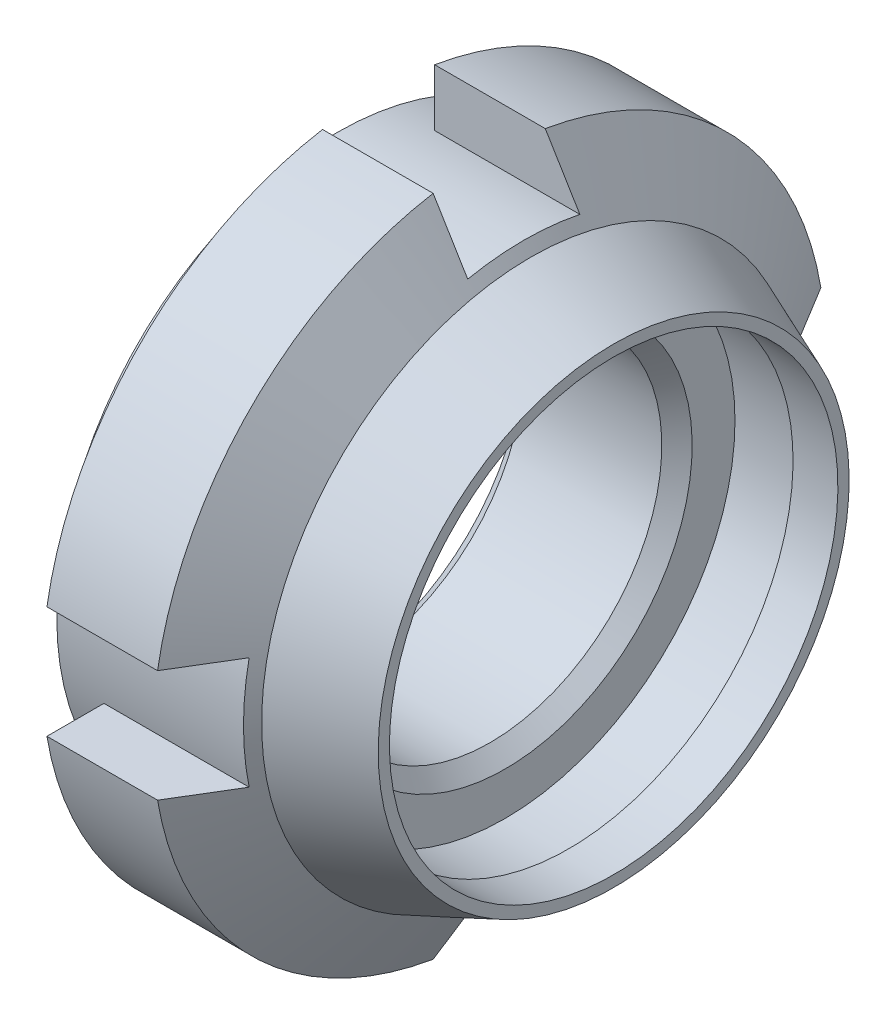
ISO-10303-21;
HEADER;
FILE_DESCRIPTION(('STEP AP214'),'2;1');
FILE_NAME('part.step','',(''),(''),'','','');
FILE_SCHEMA(('AUTOMOTIVE_DESIGN { 1 0 10303 214 1 1 1 1 }'));
ENDSEC;
DATA;
#1=APPLICATION_CONTEXT('core data for automotive mechanical design processes');
#2=APPLICATION_PROTOCOL_DEFINITION('international standard','automotive_design',2000,#1);
#3=PRODUCT_CONTEXT('',#1,'mechanical');
#4=PRODUCT('Part','Part','',(#3));
#5=PRODUCT_RELATED_PRODUCT_CATEGORY('part','',(#4));
#6=PRODUCT_DEFINITION_FORMATION('','',#4);
#7=PRODUCT_DEFINITION_CONTEXT('part definition',#1,'design');
#8=PRODUCT_DEFINITION('design','',#6,#7);
#9=PRODUCT_DEFINITION_SHAPE('','',#8);
#10=(LENGTH_UNIT() NAMED_UNIT(*) SI_UNIT(.MILLI.,.METRE.));
#11=(NAMED_UNIT(*) PLANE_ANGLE_UNIT() SI_UNIT($,.RADIAN.));
#12=(NAMED_UNIT(*) SI_UNIT($,.STERADIAN.) SOLID_ANGLE_UNIT());
#13=UNCERTAINTY_MEASURE_WITH_UNIT(LENGTH_MEASURE(1.E-05),#10,'distance_accuracy_value','');
#14=(GEOMETRIC_REPRESENTATION_CONTEXT(3) GLOBAL_UNCERTAINTY_ASSIGNED_CONTEXT((#13)) GLOBAL_UNIT_ASSIGNED_CONTEXT((#10,
#11,#12)) REPRESENTATION_CONTEXT('',''));
#15=CARTESIAN_POINT('',(0.,0.,0.));
#16=DIRECTION('',(0.,0.,1.));
#17=DIRECTION('',(1.,0.,0.));
#18=AXIS2_PLACEMENT_3D('',#15,#16,#17);
#19=CARTESIAN_POINT('',(0.,3.75,0.));
#20=DIRECTION('',(-1.,0.,0.));
#21=DIRECTION('',(0.,0.,1.));
#22=AXIS2_PLACEMENT_3D('',#19,#20,#21);
#23=PLANE('',#22);
#24=CARTESIAN_POINT('',(0.,0.,0.));
#25=DIRECTION('',(1.,0.,0.));
#26=DIRECTION('',(0.,1.,0.));
#27=AXIS2_PLACEMENT_3D('',#24,#25,#26);
#28=CIRCLE('',#27,5.);
#29=CARTESIAN_POINT('',(0.,5.,0.));
#30=VERTEX_POINT('',#29);
#31=EDGE_CURVE('E9',#30,#30,#28,.T.);
#32=ORIENTED_EDGE('',*,*,#31,.T.);
#33=EDGE_LOOP('',(#32));
#34=FACE_BOUND('',#33,.T.);
#35=CARTESIAN_POINT('',(0.,0.,0.));
#36=DIRECTION('',(-1.,0.,0.));
#37=DIRECTION('',(0.,1.,0.));
#38=AXIS2_PLACEMENT_3D('',#35,#36,#37);
#39=CIRCLE('',#38,7.5);
#40=CARTESIAN_POINT('',(0.,7.5,0.));
#41=VERTEX_POINT('',#40);
#42=EDGE_CURVE('E26',#41,#41,#39,.T.);
#43=ORIENTED_EDGE('',*,*,#42,.T.);
#44=EDGE_LOOP('',(#43));
#45=FACE_BOUND('',#44,.T.);
#46=ADVANCED_FACE('F15',(#34,#45),#23,.T.);
#47=CARTESIAN_POINT('',(1.11,8.25,0.));
#48=DIRECTION('',(-1.,0.,0.));
#49=DIRECTION('',(0.,0.,1.));
#50=AXIS2_PLACEMENT_3D('',#47,#48,#49);
#51=PLANE('',#50);
#52=DIRECTION('',(0.,1.,0.));
#53=VECTOR('',#52,1.);
#54=CARTESIAN_POINT('',(1.11,0.450765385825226,-1.5));
#55=LINE('',#54,#53);
#56=CARTESIAN_POINT('',(1.11,-8.87411967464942,-1.5));
#57=VERTEX_POINT('',#56);
#58=CARTESIAN_POINT('',(1.11,-7.34846922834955,-1.5));
#59=VERTEX_POINT('',#58);
#60=EDGE_CURVE('E190',#57,#59,#55,.T.);
#61=ORIENTED_EDGE('',*,*,#60,.T.);
#62=CARTESIAN_POINT('',(1.11,0.,0.));
#63=DIRECTION('',(-1.,0.,0.));
#64=DIRECTION('',(0.,1.,0.));
#65=AXIS2_PLACEMENT_3D('',#62,#63,#64);
#66=CIRCLE('',#65,7.5);
#67=CARTESIAN_POINT('',(1.11,-1.5,-7.34846922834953));
#68=VERTEX_POINT('',#67);
#69=EDGE_CURVE('E35',#68,#59,#66,.T.);
#70=ORIENTED_EDGE('',*,*,#69,.F.);
#71=DIRECTION('',(0.,0.,-1.));
#72=VECTOR('',#71,1.);
#73=CARTESIAN_POINT('',(1.11,-1.5,-4.43705983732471));
#74=LINE('',#73,#72);
#75=CARTESIAN_POINT('',(1.11,-1.5,-8.87411967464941));
#76=VERTEX_POINT('',#75);
#77=EDGE_CURVE('E277',#68,#76,#74,.T.);
#78=ORIENTED_EDGE('',*,*,#77,.T.);
#79=CARTESIAN_POINT('',(1.11,0.,0.));
#80=DIRECTION('',(-1.,0.,0.));
#81=DIRECTION('',(0.,1.,0.));
#82=AXIS2_PLACEMENT_3D('',#79,#80,#81);
#83=CIRCLE('',#82,9.);
#84=EDGE_CURVE('E442',#76,#57,#83,.T.);
#85=ORIENTED_EDGE('',*,*,#84,.T.);
#86=EDGE_LOOP('',(#61,#70,#78,#85));
#87=FACE_BOUND('',#86,.T.);
#88=ADVANCED_FACE('F356',(#87),#51,.T.);
#89=CARTESIAN_POINT('',(7.4,3.15,0.));
#90=DIRECTION('',(1.,0.,0.));
#91=DIRECTION('',(0.,0.,-1.));
#92=AXIS2_PLACEMENT_3D('',#89,#90,#91);
#93=PLANE('',#92);
#94=CARTESIAN_POINT('',(7.4,0.,0.));
#95=DIRECTION('',(-1.,0.,0.));
#96=DIRECTION('',(0.,1.,0.));
#97=AXIS2_PLACEMENT_3D('',#94,#95,#96);
#98=CIRCLE('',#97,6.);
#99=CARTESIAN_POINT('',(7.4,6.,0.));
#100=VERTEX_POINT('',#99);
#101=EDGE_CURVE('E454',#100,#100,#98,.T.);
#102=ORIENTED_EDGE('',*,*,#101,.T.);
#103=EDGE_LOOP('',(#102));
#104=FACE_BOUND('',#103,.T.);
#105=CARTESIAN_POINT('',(7.4,0.,0.));
#106=DIRECTION('',(-1.,0.,0.));
#107=DIRECTION('',(0.,1.,0.));
#108=AXIS2_PLACEMENT_3D('',#105,#106,#107);
#109=CIRCLE('',#108,6.3);
#110=CARTESIAN_POINT('',(7.4,6.3,0.));
#111=VERTEX_POINT('',#110);
#112=EDGE_CURVE('E166',#111,#111,#109,.T.);
#113=ORIENTED_EDGE('',*,*,#112,.F.);
#114=EDGE_LOOP('',(#113));
#115=FACE_BOUND('',#114,.T.);
#116=ADVANCED_FACE('F362',(#104,#115),#93,.T.);
#117=CARTESIAN_POINT('',(4.5,5.57317073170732,0.));
#118=DIRECTION('',(1.,0.,0.));
#119=DIRECTION('',(0.,0.,-1.));
#120=AXIS2_PLACEMENT_3D('',#117,#118,#119);
#121=PLANE('',#120);
#122=CARTESIAN_POINT('',(4.5,0.,0.));
#123=DIRECTION('',(-1.,0.,0.));
#124=DIRECTION('',(0.,1.,0.));
#125=AXIS2_PLACEMENT_3D('',#122,#123,#124);
#126=CIRCLE('',#125,5.);
#127=CARTESIAN_POINT('',(4.5,5.,0.));
#128=VERTEX_POINT('',#127);
#129=EDGE_CURVE('E457',#128,#128,#126,.T.);
#130=ORIENTED_EDGE('',*,*,#129,.T.);
#131=EDGE_LOOP('',(#130));
#132=FACE_BOUND('',#131,.T.);
#133=CARTESIAN_POINT('',(4.5,0.,0.));
#134=DIRECTION('',(-1.,0.,0.));
#135=DIRECTION('',(0.,1.,0.));
#136=AXIS2_PLACEMENT_3D('',#133,#134,#135);
#137=CIRCLE('',#136,6.14634146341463);
#138=CARTESIAN_POINT('',(4.5,6.14634146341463,0.));
#139=VERTEX_POINT('',#138);
#140=EDGE_CURVE('E175',#139,#139,#137,.T.);
#141=ORIENTED_EDGE('',*,*,#140,.F.);
#142=EDGE_LOOP('',(#141));
#143=FACE_BOUND('',#142,.T.);
#144=ADVANCED_FACE('F369',(#132,#143),#121,.T.);
#145=CARTESIAN_POINT('',(6.2,6.07317073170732,0.));
#146=DIRECTION('',(-1.,0.,0.));
#147=DIRECTION('',(0.,0.,1.));
#148=AXIS2_PLACEMENT_3D('',#145,#146,#147);
#149=PLANE('',#148);
#150=CARTESIAN_POINT('',(6.2,0.,0.));
#151=DIRECTION('',(-1.,0.,0.));
#152=DIRECTION('',(0.,1.,0.));
#153=AXIS2_PLACEMENT_3D('',#150,#151,#152);
#154=CIRCLE('',#153,6.);
#155=CARTESIAN_POINT('',(6.2,6.,0.));
#156=VERTEX_POINT('',#155);
#157=EDGE_CURVE('E480',#156,#156,#154,.T.);
#158=ORIENTED_EDGE('',*,*,#157,.F.);
#159=EDGE_LOOP('',(#158));
#160=FACE_BOUND('',#159,.T.);
#161=CARTESIAN_POINT('',(6.2,0.,0.));
#162=DIRECTION('',(-1.,0.,0.));
#163=DIRECTION('',(0.,1.,0.));
#164=AXIS2_PLACEMENT_3D('',#161,#162,#163);
#165=CIRCLE('',#164,6.14634146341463);
#166=CARTESIAN_POINT('',(6.2,6.14634146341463,0.));
#167=VERTEX_POINT('',#166);
#168=EDGE_CURVE('E252',#167,#167,#165,.T.);
#169=ORIENTED_EDGE('',*,*,#168,.T.);
#170=EDGE_LOOP('',(#169));
#171=FACE_BOUND('',#170,.T.);
#172=ADVANCED_FACE('F373',(#160,#171),#149,.T.);
#173=CARTESIAN_POINT('',(1.11,8.25,0.));
#174=DIRECTION('',(-1.,0.,0.));
#175=DIRECTION('',(0.,0.,1.));
#176=AXIS2_PLACEMENT_3D('',#173,#174,#175);
#177=PLANE('',#176);
#178=DIRECTION('',(0.,-1.,0.));
#179=VECTOR('',#178,1.);
#180=CARTESIAN_POINT('',(1.11,-0.312059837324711,1.5));
#181=LINE('',#180,#179);
#182=CARTESIAN_POINT('',(1.11,-7.34846922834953,1.5));
#183=VERTEX_POINT('',#182);
#184=CARTESIAN_POINT('',(1.11,-8.87411967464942,1.5));
#185=VERTEX_POINT('',#184);
#186=EDGE_CURVE('E180',#183,#185,#181,.T.);
#187=ORIENTED_EDGE('',*,*,#186,.T.);
#188=CARTESIAN_POINT('',(1.11,0.,0.));
#189=DIRECTION('',(-1.,0.,0.));
#190=DIRECTION('',(0.,1.,0.));
#191=AXIS2_PLACEMENT_3D('',#188,#189,#190);
#192=CIRCLE('',#191,9.);
#193=CARTESIAN_POINT('',(1.11,-1.5,8.87411967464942));
#194=VERTEX_POINT('',#193);
#195=EDGE_CURVE('E176',#185,#194,#192,.T.);
#196=ORIENTED_EDGE('',*,*,#195,.T.);
#197=DIRECTION('',(0.,0.,-1.));
#198=VECTOR('',#197,1.);
#199=CARTESIAN_POINT('',(1.11,-1.5,3.67423461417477));
#200=LINE('',#199,#198);
#201=CARTESIAN_POINT('',(1.11,-1.5,7.34846922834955));
#202=VERTEX_POINT('',#201);
#203=EDGE_CURVE('E181',#194,#202,#200,.T.);
#204=ORIENTED_EDGE('',*,*,#203,.T.);
#205=CARTESIAN_POINT('',(1.11,0.,0.));
#206=DIRECTION('',(-1.,0.,0.));
#207=DIRECTION('',(0.,1.,0.));
#208=AXIS2_PLACEMENT_3D('',#205,#206,#207);
#209=CIRCLE('',#208,7.5);
#210=EDGE_CURVE('E236',#183,#202,#209,.T.);
#211=ORIENTED_EDGE('',*,*,#210,.F.);
#212=EDGE_LOOP('',(#187,#196,#204,#211));
#213=FACE_BOUND('',#212,.T.);
#214=ADVANCED_FACE('F377',(#213),#177,.T.);
#215=CARTESIAN_POINT('',(1.11,8.25,0.));
#216=DIRECTION('',(-1.,0.,0.));
#217=DIRECTION('',(0.,0.,1.));
#218=AXIS2_PLACEMENT_3D('',#215,#216,#217);
#219=PLANE('',#218);
#220=DIRECTION('',(0.,0.,1.));
#221=VECTOR('',#220,1.);
#222=CARTESIAN_POINT('',(1.11,1.5,-3.67423461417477));
#223=LINE('',#222,#221);
#224=CARTESIAN_POINT('',(1.11,1.5,-8.87411967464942));
#225=VERTEX_POINT('',#224);
#226=CARTESIAN_POINT('',(1.11,1.5,-7.34846922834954));
#227=VERTEX_POINT('',#226);
#228=EDGE_CURVE('E194',#225,#227,#223,.T.);
#229=ORIENTED_EDGE('',*,*,#228,.T.);
#230=CARTESIAN_POINT('',(1.11,0.,0.));
#231=DIRECTION('',(-1.,0.,0.));
#232=DIRECTION('',(0.,1.,0.));
#233=AXIS2_PLACEMENT_3D('',#230,#231,#232);
#234=CIRCLE('',#233,7.5);
#235=CARTESIAN_POINT('',(1.11,7.34846922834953,-1.5));
#236=VERTEX_POINT('',#235);
#237=EDGE_CURVE('E260',#236,#227,#234,.T.);
#238=ORIENTED_EDGE('',*,*,#237,.F.);
#239=DIRECTION('',(0.,1.,0.));
#240=VECTOR('',#239,1.);
#241=CARTESIAN_POINT('',(1.11,8.56205983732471,-1.5));
#242=LINE('',#241,#240);
#243=CARTESIAN_POINT('',(1.11,8.87411967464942,-1.5));
#244=VERTEX_POINT('',#243);
#245=EDGE_CURVE('E191',#236,#244,#242,.T.);
#246=ORIENTED_EDGE('',*,*,#245,.T.);
#247=CARTESIAN_POINT('',(1.11,0.,0.));
#248=DIRECTION('',(-1.,0.,0.));
#249=DIRECTION('',(0.,1.,0.));
#250=AXIS2_PLACEMENT_3D('',#247,#248,#249);
#251=CIRCLE('',#250,9.);
#252=EDGE_CURVE('E145',#244,#225,#251,.T.);
#253=ORIENTED_EDGE('',*,*,#252,.T.);
#254=EDGE_LOOP('',(#229,#238,#246,#253));
#255=FACE_BOUND('',#254,.T.);
#256=ADVANCED_FACE('F381',(#255),#219,.T.);
#257=CARTESIAN_POINT('',(1.11,8.25,0.));
#258=DIRECTION('',(-1.,0.,0.));
#259=DIRECTION('',(0.,0.,1.));
#260=AXIS2_PLACEMENT_3D('',#257,#258,#259);
#261=PLANE('',#260);
#262=DIRECTION('',(0.,0.,1.));
#263=VECTOR('',#262,1.);
#264=CARTESIAN_POINT('',(1.11,1.5,4.43705983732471));
#265=LINE('',#264,#263);
#266=CARTESIAN_POINT('',(1.11,1.5,7.34846922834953));
#267=VERTEX_POINT('',#266);
#268=CARTESIAN_POINT('',(1.11,1.5,8.87411967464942));
#269=VERTEX_POINT('',#268);
#270=EDGE_CURVE('E202',#267,#269,#265,.T.);
#271=ORIENTED_EDGE('',*,*,#270,.T.);
#272=CARTESIAN_POINT('',(1.11,0.,0.));
#273=DIRECTION('',(-1.,0.,0.));
#274=DIRECTION('',(0.,1.,0.));
#275=AXIS2_PLACEMENT_3D('',#272,#273,#274);
#276=CIRCLE('',#275,9.);
#277=CARTESIAN_POINT('',(1.11,8.87411967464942,1.5));
#278=VERTEX_POINT('',#277);
#279=EDGE_CURVE('E198',#269,#278,#276,.T.);
#280=ORIENTED_EDGE('',*,*,#279,.T.);
#281=DIRECTION('',(0.,-1.,0.));
#282=VECTOR('',#281,1.);
#283=CARTESIAN_POINT('',(1.11,7.79923461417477,1.5));
#284=LINE('',#283,#282);
#285=CARTESIAN_POINT('',(1.11,7.34846922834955,1.5));
#286=VERTEX_POINT('',#285);
#287=EDGE_CURVE('E203',#278,#286,#284,.T.);
#288=ORIENTED_EDGE('',*,*,#287,.T.);
#289=CARTESIAN_POINT('',(1.11,0.,0.));
#290=DIRECTION('',(-1.,0.,0.));
#291=DIRECTION('',(0.,1.,0.));
#292=AXIS2_PLACEMENT_3D('',#289,#290,#291);
#293=CIRCLE('',#292,7.5);
#294=EDGE_CURVE('E221',#267,#286,#293,.T.);
#295=ORIENTED_EDGE('',*,*,#294,.F.);
#296=EDGE_LOOP('',(#271,#280,#288,#295));
#297=FACE_BOUND('',#296,.T.);
#298=ADVANCED_FACE('F385',(#297),#261,.T.);
#299=CARTESIAN_POINT('',(2.59,0.,0.));
#300=DIRECTION('',(-1.,0.,0.));
#301=DIRECTION('',(0.,0.,1.));
#302=AXIS2_PLACEMENT_3D('',#299,#300,#301);
#303=CYLINDRICAL_SURFACE('',#302,9.);
#304=DIRECTION('',(-1.,0.,0.));
#305=VECTOR('',#304,1.);
#306=CARTESIAN_POINT('',(2.59,-8.87411967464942,-1.5));
#307=LINE('',#306,#305);
#308=CARTESIAN_POINT('',(4.07,-8.87411967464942,-1.5));
#309=VERTEX_POINT('',#308);
#310=EDGE_CURVE('E302',#309,#57,#307,.T.);
#311=ORIENTED_EDGE('',*,*,#310,.T.);
#312=ORIENTED_EDGE('',*,*,#84,.F.);
#313=DIRECTION('',(1.,0.,0.));
#314=VECTOR('',#313,1.);
#315=CARTESIAN_POINT('',(2.59,-1.5,-8.87411967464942));
#316=LINE('',#315,#314);
#317=CARTESIAN_POINT('',(4.07000000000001,-1.5,-8.87411967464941));
#318=VERTEX_POINT('',#317);
#319=EDGE_CURVE('E306',#76,#318,#316,.T.);
#320=ORIENTED_EDGE('',*,*,#319,.T.);
#321=CARTESIAN_POINT('',(4.07,0.,0.));
#322=DIRECTION('',(-1.,0.,0.));
#323=DIRECTION('',(0.,1.,0.));
#324=AXIS2_PLACEMENT_3D('',#321,#322,#323);
#325=CIRCLE('',#324,9.);
#326=EDGE_CURVE('E437',#318,#309,#325,.T.);
#327=ORIENTED_EDGE('',*,*,#326,.T.);
#328=EDGE_LOOP('',(#311,#312,#320,#327));
#329=FACE_BOUND('',#328,.T.);
#330=ADVANCED_FACE('F389',(#329),#303,.T.);
#331=CARTESIAN_POINT('',(2.59,0.,0.));
#332=DIRECTION('',(-1.,0.,0.));
#333=DIRECTION('',(0.,0.,1.));
#334=AXIS2_PLACEMENT_3D('',#331,#332,#333);
#335=CYLINDRICAL_SURFACE('',#334,9.);
#336=DIRECTION('',(1.,0.,0.));
#337=VECTOR('',#336,1.);
#338=CARTESIAN_POINT('',(2.59,-8.87411967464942,1.5));
#339=LINE('',#338,#337);
#340=CARTESIAN_POINT('',(4.07,-8.87411967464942,1.5));
#341=VERTEX_POINT('',#340);
#342=EDGE_CURVE('E270',#185,#341,#339,.T.);
#343=ORIENTED_EDGE('',*,*,#342,.T.);
#344=CARTESIAN_POINT('',(4.07,0.,0.));
#345=DIRECTION('',(-1.,0.,0.));
#346=DIRECTION('',(0.,1.,0.));
#347=AXIS2_PLACEMENT_3D('',#344,#345,#346);
#348=CIRCLE('',#347,9.);
#349=CARTESIAN_POINT('',(4.07,-1.5,8.87411967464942));
#350=VERTEX_POINT('',#349);
#351=EDGE_CURVE('E266',#341,#350,#348,.T.);
#352=ORIENTED_EDGE('',*,*,#351,.T.);
#353=DIRECTION('',(-1.,0.,0.));
#354=VECTOR('',#353,1.);
#355=CARTESIAN_POINT('',(2.59,-1.5,8.87411967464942));
#356=LINE('',#355,#354);
#357=EDGE_CURVE('E155',#350,#194,#356,.T.);
#358=ORIENTED_EDGE('',*,*,#357,.T.);
#359=ORIENTED_EDGE('',*,*,#195,.F.);
#360=EDGE_LOOP('',(#343,#352,#358,#359));
#361=FACE_BOUND('',#360,.T.);
#362=ADVANCED_FACE('F393',(#361),#335,.T.);
#363=CARTESIAN_POINT('',(2.59,0.,0.));
#364=DIRECTION('',(-1.,0.,0.));
#365=DIRECTION('',(0.,0.,1.));
#366=AXIS2_PLACEMENT_3D('',#363,#364,#365);
#367=CYLINDRICAL_SURFACE('',#366,9.);
#368=DIRECTION('',(-1.,0.,0.));
#369=VECTOR('',#368,1.);
#370=CARTESIAN_POINT('',(2.59,1.5,-8.87411967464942));
#371=LINE('',#370,#369);
#372=CARTESIAN_POINT('',(4.07,1.5,-8.87411967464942));
#373=VERTEX_POINT('',#372);
#374=EDGE_CURVE('E148',#373,#225,#371,.T.);
#375=ORIENTED_EDGE('',*,*,#374,.T.);
#376=ORIENTED_EDGE('',*,*,#252,.F.);
#377=DIRECTION('',(1.,0.,0.));
#378=VECTOR('',#377,1.);
#379=CARTESIAN_POINT('',(2.59,8.87411967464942,-1.5));
#380=LINE('',#379,#378);
#381=CARTESIAN_POINT('',(4.07,8.87411967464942,-1.5));
#382=VERTEX_POINT('',#381);
#383=EDGE_CURVE('E125',#244,#382,#380,.T.);
#384=ORIENTED_EDGE('',*,*,#383,.T.);
#385=CARTESIAN_POINT('',(4.07,0.,0.));
#386=DIRECTION('',(-1.,0.,0.));
#387=DIRECTION('',(0.,1.,0.));
#388=AXIS2_PLACEMENT_3D('',#385,#386,#387);
#389=CIRCLE('',#388,9.);
#390=EDGE_CURVE('E134',#382,#373,#389,.T.);
#391=ORIENTED_EDGE('',*,*,#390,.T.);
#392=EDGE_LOOP('',(#375,#376,#384,#391));
#393=FACE_BOUND('',#392,.T.);
#394=ADVANCED_FACE('F143',(#393),#367,.T.);
#395=CARTESIAN_POINT('',(2.59,0.,0.));
#396=DIRECTION('',(-1.,0.,0.));
#397=DIRECTION('',(0.,0.,1.));
#398=AXIS2_PLACEMENT_3D('',#395,#396,#397);
#399=CYLINDRICAL_SURFACE('',#398,9.);
#400=DIRECTION('',(1.,0.,0.));
#401=VECTOR('',#400,1.);
#402=CARTESIAN_POINT('',(2.59,1.5,8.87411967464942));
#403=LINE('',#402,#401);
#404=CARTESIAN_POINT('',(4.07,1.5,8.87411967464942));
#405=VERTEX_POINT('',#404);
#406=EDGE_CURVE('E141',#269,#405,#403,.T.);
#407=ORIENTED_EDGE('',*,*,#406,.T.);
#408=CARTESIAN_POINT('',(4.07,0.,0.));
#409=DIRECTION('',(-1.,0.,0.));
#410=DIRECTION('',(0.,1.,0.));
#411=AXIS2_PLACEMENT_3D('',#408,#409,#410);
#412=CIRCLE('',#411,9.);
#413=CARTESIAN_POINT('',(4.07,8.87411967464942,1.5));
#414=VERTEX_POINT('',#413);
#415=EDGE_CURVE('E182',#405,#414,#412,.T.);
#416=ORIENTED_EDGE('',*,*,#415,.T.);
#417=DIRECTION('',(-1.,0.,0.));
#418=VECTOR('',#417,1.);
#419=CARTESIAN_POINT('',(2.59,8.87411967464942,1.5));
#420=LINE('',#419,#418);
#421=EDGE_CURVE('E186',#414,#278,#420,.T.);
#422=ORIENTED_EDGE('',*,*,#421,.T.);
#423=ORIENTED_EDGE('',*,*,#279,.F.);
#424=EDGE_LOOP('',(#407,#416,#422,#423));
#425=FACE_BOUND('',#424,.T.);
#426=ADVANCED_FACE('F400',(#425),#399,.T.);
#427=CARTESIAN_POINT('',(0.,8.87411967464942,-1.5));
#428=DIRECTION('',(0.,0.,1.));
#429=DIRECTION('',(1.,0.,0.));
#430=AXIS2_PLACEMENT_3D('',#427,#428,#429);
#431=PLANE('',#430);
#432=CARTESIAN_POINT('',(4.07,8.87411967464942,-1.5));
#433=CARTESIAN_POINT('',(4.57599572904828,8.04194670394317,-1.5));
#434=CARTESIAN_POINT('',(4.995,7.34846922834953,-1.5));
#435=(BOUNDED_CURVE() B_SPLINE_CURVE(2,(#432,#433,#434),.UNSPECIFIED.,.F.,
.F.) B_SPLINE_CURVE_WITH_KNOTS((3,3),(0.,1.74932331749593),
.UNSPECIFIED.) CURVE() GEOMETRIC_REPRESENTATION_ITEM() RATIONAL_B_SPLINE_CURVE((1.,
1.005272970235,1.00193381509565)) REPRESENTATION_ITEM(''));
#436=CARTESIAN_POINT('',(4.995,7.34846922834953,-1.5));
#437=VERTEX_POINT('',#436);
#438=EDGE_CURVE('E120',#382,#437,#435,.T.);
#439=ORIENTED_EDGE('',*,*,#438,.F.);
#440=ORIENTED_EDGE('',*,*,#383,.F.);
#441=ORIENTED_EDGE('',*,*,#245,.F.);
#442=DIRECTION('',(1.,0.,0.));
#443=VECTOR('',#442,1.);
#444=CARTESIAN_POINT('',(0.,7.34846922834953,-1.5));
#445=LINE('',#444,#443);
#446=EDGE_CURVE('E127',#236,#437,#445,.T.);
#447=ORIENTED_EDGE('',*,*,#446,.T.);
#448=EDGE_LOOP('',(#439,#440,#441,#447));
#449=FACE_BOUND('',#448,.T.);
#450=ADVANCED_FACE('F122',(#449),#431,.T.);
#451=CARTESIAN_POINT('',(0.,-8.87411967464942,1.5));
#452=DIRECTION('',(0.,0.,-1.));
#453=DIRECTION('',(-1.,0.,0.));
#454=AXIS2_PLACEMENT_3D('',#451,#452,#453);
#455=PLANE('',#454);
#456=CARTESIAN_POINT('',(4.07,-8.87411967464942,1.5));
#457=CARTESIAN_POINT('',(4.57599572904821,-8.04194670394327,1.5));
#458=CARTESIAN_POINT('',(4.995,-7.34846922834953,1.5));
#459=(BOUNDED_CURVE() B_SPLINE_CURVE(2,(#456,#457,#458),.UNSPECIFIED.,.F.,
.F.) B_SPLINE_CURVE_WITH_KNOTS((3,3),(0.,1.74932331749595),
.UNSPECIFIED.) CURVE() GEOMETRIC_REPRESENTATION_ITEM() RATIONAL_B_SPLINE_CURVE((1.,
1.00527297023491,1.00193381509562)) REPRESENTATION_ITEM(''));
#460=CARTESIAN_POINT('',(4.995,-7.34846922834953,1.5));
#461=VERTEX_POINT('',#460);
#462=EDGE_CURVE('E210',#341,#461,#459,.T.);
#463=ORIENTED_EDGE('',*,*,#462,.F.);
#464=ORIENTED_EDGE('',*,*,#342,.F.);
#465=ORIENTED_EDGE('',*,*,#186,.F.);
#466=DIRECTION('',(1.,0.,0.));
#467=VECTOR('',#466,1.);
#468=CARTESIAN_POINT('',(0.,-7.34846922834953,1.5));
#469=LINE('',#468,#467);
#470=EDGE_CURVE('E234',#183,#461,#469,.T.);
#471=ORIENTED_EDGE('',*,*,#470,.T.);
#472=EDGE_LOOP('',(#463,#464,#465,#471));
#473=FACE_BOUND('',#472,.T.);
#474=ADVANCED_FACE('F406',(#473),#455,.T.);
#475=CARTESIAN_POINT('',(0.,-1.5,7.34846922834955));
#476=DIRECTION('',(0.,1.,0.));
#477=DIRECTION('',(0.,0.,1.));
#478=AXIS2_PLACEMENT_3D('',#475,#476,#477);
#479=PLANE('',#478);
#480=CARTESIAN_POINT('',(4.99499999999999,-1.5,7.34846922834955));
#481=CARTESIAN_POINT('',(4.57599572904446,-1.5,8.04194670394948));
#482=CARTESIAN_POINT('',(4.07,-1.5,8.87411967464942));
#483=(BOUNDED_CURVE() B_SPLINE_CURVE(2,(#480,#481,#482),.UNSPECIFIED.,.F.,
.F.) B_SPLINE_CURVE_WITH_KNOTS((3,3),(0.392802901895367,2.14212621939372),
.UNSPECIFIED.) CURVE() GEOMETRIC_REPRESENTATION_ITEM() RATIONAL_B_SPLINE_CURVE((1.00193381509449,
1.00527297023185,1.)) REPRESENTATION_ITEM(''));
#484=CARTESIAN_POINT('',(4.99499999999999,-1.5,7.34846922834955));
#485=VERTEX_POINT('',#484);
#486=EDGE_CURVE('E204',#485,#350,#483,.T.);
#487=ORIENTED_EDGE('',*,*,#486,.F.);
#488=DIRECTION('',(1.,0.,0.));
#489=VECTOR('',#488,1.);
#490=CARTESIAN_POINT('',(0.,-1.5,7.34846922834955));
#491=LINE('',#490,#489);
#492=EDGE_CURVE('E228',#202,#485,#491,.T.);
#493=ORIENTED_EDGE('',*,*,#492,.F.);
#494=ORIENTED_EDGE('',*,*,#203,.F.);
#495=ORIENTED_EDGE('',*,*,#357,.F.);
#496=EDGE_LOOP('',(#487,#493,#494,#495));
#497=FACE_BOUND('',#496,.T.);
#498=ADVANCED_FACE('F409',(#497),#479,.T.);
#499=CARTESIAN_POINT('',(0.,1.5,8.87411967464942));
#500=DIRECTION('',(0.,-1.,0.));
#501=DIRECTION('',(0.,0.,-1.));
#502=AXIS2_PLACEMENT_3D('',#499,#500,#501);
#503=PLANE('',#502);
#504=CARTESIAN_POINT('',(4.07,1.5,8.87411967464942));
#505=CARTESIAN_POINT('',(4.57599572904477,1.5,8.04194670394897));
#506=CARTESIAN_POINT('',(4.995,1.5,7.34846922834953));
#507=(BOUNDED_CURVE() B_SPLINE_CURVE(2,(#504,#505,#506),.UNSPECIFIED.,.F.,
.F.) B_SPLINE_CURVE_WITH_KNOTS((3,3),(0.,1.74932331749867),
.UNSPECIFIED.) CURVE() GEOMETRIC_REPRESENTATION_ITEM() RATIONAL_B_SPLINE_CURVE((1.,
1.00527297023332,1.00193381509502)) REPRESENTATION_ITEM(''));
#508=CARTESIAN_POINT('',(4.995,1.5,7.34846922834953));
#509=VERTEX_POINT('',#508);
#510=EDGE_CURVE('E167',#405,#509,#507,.T.);
#511=ORIENTED_EDGE('',*,*,#510,.F.);
#512=ORIENTED_EDGE('',*,*,#406,.F.);
#513=ORIENTED_EDGE('',*,*,#270,.F.);
#514=DIRECTION('',(1.,0.,0.));
#515=VECTOR('',#514,1.);
#516=CARTESIAN_POINT('',(0.,1.5,7.34846922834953));
#517=LINE('',#516,#515);
#518=EDGE_CURVE('E230',#267,#509,#517,.T.);
#519=ORIENTED_EDGE('',*,*,#518,.T.);
#520=EDGE_LOOP('',(#511,#512,#513,#519));
#521=FACE_BOUND('',#520,.T.);
#522=ADVANCED_FACE('F413',(#521),#503,.T.);
#523=CARTESIAN_POINT('',(0.,7.34846922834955,1.5));
#524=DIRECTION('',(0.,0.,-1.));
#525=DIRECTION('',(-1.,0.,0.));
#526=AXIS2_PLACEMENT_3D('',#523,#524,#525);
#527=PLANE('',#526);
#528=CARTESIAN_POINT('',(4.99499999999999,7.34846922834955,1.5));
#529=CARTESIAN_POINT('',(4.57599572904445,8.0419467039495,1.5));
#530=CARTESIAN_POINT('',(4.07,8.87411967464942,1.5));
#531=(BOUNDED_CURVE() B_SPLINE_CURVE(2,(#528,#529,#530),.UNSPECIFIED.,.F.,
.F.) B_SPLINE_CURVE_WITH_KNOTS((3,3),(0.392802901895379,2.14212621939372),
.UNSPECIFIED.) CURVE() GEOMETRIC_REPRESENTATION_ITEM() RATIONAL_B_SPLINE_CURVE((1.00193381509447,
1.0052729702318,1.)) REPRESENTATION_ITEM(''));
#532=CARTESIAN_POINT('',(4.99499999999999,7.34846922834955,1.5));
#533=VERTEX_POINT('',#532);
#534=EDGE_CURVE('E160',#533,#414,#531,.T.);
#535=ORIENTED_EDGE('',*,*,#534,.F.);
#536=DIRECTION('',(1.,0.,0.));
#537=VECTOR('',#536,1.);
#538=CARTESIAN_POINT('',(0.,7.34846922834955,1.5));
#539=LINE('',#538,#537);
#540=EDGE_CURVE('E229',#286,#533,#539,.T.);
#541=ORIENTED_EDGE('',*,*,#540,.F.);
#542=ORIENTED_EDGE('',*,*,#287,.F.);
#543=ORIENTED_EDGE('',*,*,#421,.F.);
#544=EDGE_LOOP('',(#535,#541,#542,#543));
#545=FACE_BOUND('',#544,.T.);
#546=ADVANCED_FACE('F417',(#545),#527,.T.);
#547=CARTESIAN_POINT('',(0.,1.5,-7.34846922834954));
#548=DIRECTION('',(0.,-1.,0.));
#549=DIRECTION('',(0.,0.,-1.));
#550=AXIS2_PLACEMENT_3D('',#547,#548,#549);
#551=PLANE('',#550);
#552=CARTESIAN_POINT('',(4.99499999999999,1.5,-7.34846922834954));
#553=CARTESIAN_POINT('',(4.57599572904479,1.5,-8.04194670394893));
#554=CARTESIAN_POINT('',(4.07,1.5,-8.87411967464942));
#555=(BOUNDED_CURVE() B_SPLINE_CURVE(2,(#552,#553,#554),.UNSPECIFIED.,.F.,
.F.) B_SPLINE_CURVE_WITH_KNOTS((3,3),(0.392802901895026,2.14212621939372),
.UNSPECIFIED.) CURVE() GEOMETRIC_REPRESENTATION_ITEM() RATIONAL_B_SPLINE_CURVE((1.00193381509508,
1.00527297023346,1.)) REPRESENTATION_ITEM(''));
#556=CARTESIAN_POINT('',(4.99499999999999,1.5,-7.34846922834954));
#557=VERTEX_POINT('',#556);
#558=EDGE_CURVE('E130',#557,#373,#555,.T.);
#559=ORIENTED_EDGE('',*,*,#558,.F.);
#560=DIRECTION('',(1.,0.,0.));
#561=VECTOR('',#560,1.);
#562=CARTESIAN_POINT('',(0.,1.5,-7.34846922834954));
#563=LINE('',#562,#561);
#564=EDGE_CURVE('E256',#227,#557,#563,.T.);
#565=ORIENTED_EDGE('',*,*,#564,.F.);
#566=ORIENTED_EDGE('',*,*,#228,.F.);
#567=ORIENTED_EDGE('',*,*,#374,.F.);
#568=EDGE_LOOP('',(#559,#565,#566,#567));
#569=FACE_BOUND('',#568,.T.);
#570=ADVANCED_FACE('F421',(#569),#551,.T.);
#571=CARTESIAN_POINT('',(0.,-1.5,-8.87411967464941));
#572=DIRECTION('',(0.,1.,0.));
#573=DIRECTION('',(0.,0.,1.));
#574=AXIS2_PLACEMENT_3D('',#571,#572,#573);
#575=PLANE('',#574);
#576=CARTESIAN_POINT('',(4.07,-1.5,-8.87411967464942));
#577=CARTESIAN_POINT('',(4.57599572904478,-1.5,-8.04194670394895));
#578=CARTESIAN_POINT('',(4.995,-1.5,-7.34846922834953));
#579=(BOUNDED_CURVE() B_SPLINE_CURVE(2,(#576,#577,#578),.UNSPECIFIED.,.F.,
.F.) B_SPLINE_CURVE_WITH_KNOTS((3,3),(0.,1.74932331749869),
.UNSPECIFIED.) CURVE() GEOMETRIC_REPRESENTATION_ITEM() RATIONAL_B_SPLINE_CURVE((1.,
1.00527297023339,1.00193381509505)) REPRESENTATION_ITEM(''));
#580=CARTESIAN_POINT('',(4.995,-1.5,-7.34846922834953));
#581=VERTEX_POINT('',#580);
#582=EDGE_CURVE('E220',#318,#581,#579,.T.);
#583=ORIENTED_EDGE('',*,*,#582,.F.);
#584=ORIENTED_EDGE('',*,*,#319,.F.);
#585=ORIENTED_EDGE('',*,*,#77,.F.);
#586=DIRECTION('',(1.,0.,0.));
#587=VECTOR('',#586,1.);
#588=CARTESIAN_POINT('',(0.,-1.5,-7.34846922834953));
#589=LINE('',#588,#587);
#590=EDGE_CURVE('E235',#68,#581,#589,.T.);
#591=ORIENTED_EDGE('',*,*,#590,.T.);
#592=EDGE_LOOP('',(#583,#584,#585,#591));
#593=FACE_BOUND('',#592,.T.);
#594=ADVANCED_FACE('F424',(#593),#575,.T.);
#595=CARTESIAN_POINT('',(0.,-7.34846922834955,-1.5));
#596=DIRECTION('',(0.,0.,1.));
#597=DIRECTION('',(1.,0.,0.));
#598=AXIS2_PLACEMENT_3D('',#595,#596,#597);
#599=PLANE('',#598);
#600=CARTESIAN_POINT('',(4.99499999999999,-7.34846922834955,-1.5));
#601=CARTESIAN_POINT('',(4.57599572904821,-8.04194670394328,-1.5));
#602=CARTESIAN_POINT('',(4.07,-8.87411967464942,-1.5));
#603=(BOUNDED_CURVE() B_SPLINE_CURVE(2,(#600,#601,#602),.UNSPECIFIED.,.F.,
.F.) B_SPLINE_CURVE_WITH_KNOTS((3,3),(0.392802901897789,2.14212621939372),
.UNSPECIFIED.) CURVE() GEOMETRIC_REPRESENTATION_ITEM() RATIONAL_B_SPLINE_CURVE((1.00193381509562,
1.00527297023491,1.)) REPRESENTATION_ITEM(''));
#604=CARTESIAN_POINT('',(4.99499999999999,-7.34846922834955,-1.5));
#605=VERTEX_POINT('',#604);
#606=EDGE_CURVE('E211',#605,#309,#603,.T.);
#607=ORIENTED_EDGE('',*,*,#606,.F.);
#608=DIRECTION('',(1.,0.,0.));
#609=VECTOR('',#608,1.);
#610=CARTESIAN_POINT('',(0.,-7.34846922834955,-1.5));
#611=LINE('',#610,#609);
#612=EDGE_CURVE('E240',#59,#605,#611,.T.);
#613=ORIENTED_EDGE('',*,*,#612,.F.);
#614=ORIENTED_EDGE('',*,*,#60,.F.);
#615=ORIENTED_EDGE('',*,*,#310,.F.);
#616=EDGE_LOOP('',(#607,#613,#614,#615));
#617=FACE_BOUND('',#616,.T.);
#618=ADVANCED_FACE('F327',(#617),#599,.T.);
#619=CARTESIAN_POINT('',(6.8,0.,0.));
#620=DIRECTION('',(-1.,0.,0.));
#621=DIRECTION('',(0.,0.,1.));
#622=AXIS2_PLACEMENT_3D('',#619,#620,#621);
#623=CYLINDRICAL_SURFACE('',#622,6.);
#624=ORIENTED_EDGE('',*,*,#101,.F.);
#625=EDGE_LOOP('',(#624));
#626=FACE_BOUND('',#625,.T.);
#627=ORIENTED_EDGE('',*,*,#157,.T.);
#628=EDGE_LOOP('',(#627));
#629=FACE_BOUND('',#628,.T.);
#630=ADVANCED_FACE('F345',(#626,#629),#623,.F.);
#631=CARTESIAN_POINT('',(5.35,0.,0.));
#632=DIRECTION('',(-1.,0.,0.));
#633=DIRECTION('',(0.,0.,1.));
#634=AXIS2_PLACEMENT_3D('',#631,#632,#633);
#635=CYLINDRICAL_SURFACE('',#634,6.14634146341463);
#636=ORIENTED_EDGE('',*,*,#168,.F.);
#637=EDGE_LOOP('',(#636));
#638=FACE_BOUND('',#637,.T.);
#639=ORIENTED_EDGE('',*,*,#140,.T.);
#640=EDGE_LOOP('',(#639));
#641=FACE_BOUND('',#640,.T.);
#642=ADVANCED_FACE('F325',(#638,#641),#635,.F.);
#643=DIRECTION('',(0.707106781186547,0.707106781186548,0.));
#644=VECTOR('',#643,1.);
#645=CARTESIAN_POINT('',(498999.499999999,499000.,-1.22215714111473E-10));
#646=LINE('',#645,#644);
#647=CARTESIAN_POINT('',(-0.499999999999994,0.,0.));
#648=DIRECTION('',(1.,0.,0.));
#649=AXIS1_PLACEMENT('',#647,#648);
#650=SURFACE_OF_REVOLUTION('',#646,#649);
#651=ORIENTED_EDGE('',*,*,#129,.F.);
#652=EDGE_LOOP('',(#651));
#653=FACE_BOUND('',#652,.T.);
#654=CARTESIAN_POINT('',(4.094,0.,0.));
#655=DIRECTION('',(-1.,0.,0.));
#656=DIRECTION('',(0.,1.,0.));
#657=AXIS2_PLACEMENT_3D('',#654,#655,#656);
#658=CIRCLE('',#657,4.594);
#659=CARTESIAN_POINT('',(4.094,4.594,0.));
#660=VERTEX_POINT('',#659);
#661=EDGE_CURVE('E484',#660,#660,#658,.T.);
#662=ORIENTED_EDGE('',*,*,#661,.T.);
#663=EDGE_LOOP('',(#662));
#664=FACE_BOUND('',#663,.T.);
#665=ADVANCED_FACE('F321',(#653,#664),#650,.F.);
#666=CARTESIAN_POINT('',(2.25,0.,0.));
#667=DIRECTION('',(-1.,0.,0.));
#668=DIRECTION('',(0.,0.,1.));
#669=AXIS2_PLACEMENT_3D('',#666,#667,#668);
#670=CYLINDRICAL_SURFACE('',#669,4.594);
#671=ORIENTED_EDGE('',*,*,#661,.F.);
#672=EDGE_LOOP('',(#671));
#673=FACE_BOUND('',#672,.T.);
#674=CARTESIAN_POINT('',(0.405999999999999,0.,0.));
#675=DIRECTION('',(-1.,0.,0.));
#676=DIRECTION('',(0.,1.,0.));
#677=AXIS2_PLACEMENT_3D('',#674,#675,#676);
#678=CIRCLE('',#677,4.594);
#679=CARTESIAN_POINT('',(0.405999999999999,4.594,0.));
#680=VERTEX_POINT('',#679);
#681=EDGE_CURVE('E168',#680,#680,#678,.T.);
#682=ORIENTED_EDGE('',*,*,#681,.T.);
#683=EDGE_LOOP('',(#682));
#684=FACE_BOUND('',#683,.T.);
#685=ADVANCED_FACE('F17',(#673,#684),#670,.F.);
#686=DIRECTION('',(-0.707106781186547,0.707106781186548,0.));
#687=VECTOR('',#686,1.);
#688=CARTESIAN_POINT('',(-498994.999999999,499000.,-1.22215714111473E-10));
#689=LINE('',#688,#687);
#690=CARTESIAN_POINT('',(4.99999999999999,0.,0.));
#691=DIRECTION('',(-1.,0.,0.));
#692=AXIS1_PLACEMENT('',#690,#691);
#693=SURFACE_OF_REVOLUTION('',#689,#692);
#694=ORIENTED_EDGE('',*,*,#31,.F.);
#695=EDGE_LOOP('',(#694));
#696=FACE_BOUND('',#695,.T.);
#697=ORIENTED_EDGE('',*,*,#681,.F.);
#698=EDGE_LOOP('',(#697));
#699=FACE_BOUND('',#698,.T.);
#700=ADVANCED_FACE('F329',(#696,#699),#693,.F.);
#701=DIRECTION('',(0.926739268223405,-0.375705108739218,0.));
#702=VECTOR('',#701,1.);
#703=CARTESIAN_POINT('',(-499000.,202306.597297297,-4.95491888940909E-11));
#704=LINE('',#703,#702);
#705=CARTESIAN_POINT('',(22.94,0.,0.));
#706=DIRECTION('',(-1.,0.,0.));
#707=AXIS1_PLACEMENT('',#705,#706);
#708=SURFACE_OF_REVOLUTION('',#704,#707);
#709=ORIENTED_EDGE('',*,*,#112,.T.);
#710=EDGE_LOOP('',(#709));
#711=FACE_BOUND('',#710,.T.);
#712=CARTESIAN_POINT('',(5.18,0.,0.));
#713=DIRECTION('',(-1.,0.,0.));
#714=DIRECTION('',(0.,1.,0.));
#715=AXIS2_PLACEMENT_3D('',#712,#713,#714);
#716=CIRCLE('',#715,7.2);
#717=CARTESIAN_POINT('',(5.18,7.2,0.));
#718=VERTEX_POINT('',#717);
#719=EDGE_CURVE('E290',#718,#718,#716,.T.);
#720=ORIENTED_EDGE('',*,*,#719,.F.);
#721=EDGE_LOOP('',(#720));
#722=FACE_BOUND('',#721,.T.);
#723=ADVANCED_FACE('F332',(#711,#722),#708,.F.);
#724=DIRECTION('',(0.524888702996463,-0.851170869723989,0.));
#725=VECTOR('',#724,1.);
#726=CARTESIAN_POINT('',(4.625,8.1,0.));
#727=LINE('',#726,#725);
#728=CARTESIAN_POINT('',(9.62000000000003,0.,0.));
#729=DIRECTION('',(-1.,0.,0.));
#730=AXIS1_PLACEMENT('',#728,#729);
#731=SURFACE_OF_REVOLUTION('',#727,#730);
#732=ORIENTED_EDGE('',*,*,#719,.T.);
#733=EDGE_LOOP('',(#732));
#734=FACE_BOUND('',#733,.T.);
#735=ORIENTED_EDGE('',*,*,#462,.T.);
#736=CARTESIAN_POINT('',(4.99499999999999,0.,0.));
#737=DIRECTION('',(1.,0.,0.));
#738=DIRECTION('',(0.,-0.97979589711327,0.200000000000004));
#739=AXIS2_PLACEMENT_3D('',#736,#737,#738);
#740=CIRCLE('',#739,7.50000000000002);
#741=EDGE_CURVE('E219',#461,#605,#740,.T.);
#742=ORIENTED_EDGE('',*,*,#741,.T.);
#743=ORIENTED_EDGE('',*,*,#606,.T.);
#744=ORIENTED_EDGE('',*,*,#326,.F.);
#745=ORIENTED_EDGE('',*,*,#582,.T.);
#746=CARTESIAN_POINT('',(4.995,0.,0.));
#747=DIRECTION('',(1.,0.,0.));
#748=DIRECTION('',(0.,-0.200000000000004,-0.97979589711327));
#749=AXIS2_PLACEMENT_3D('',#746,#747,#748);
#750=CIRCLE('',#749,7.49999999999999);
#751=EDGE_CURVE('E245',#581,#557,#750,.T.);
#752=ORIENTED_EDGE('',*,*,#751,.T.);
#753=ORIENTED_EDGE('',*,*,#558,.T.);
#754=ORIENTED_EDGE('',*,*,#390,.F.);
#755=ORIENTED_EDGE('',*,*,#438,.T.);
#756=CARTESIAN_POINT('',(4.99499999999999,0.,0.));
#757=DIRECTION('',(1.,0.,0.));
#758=DIRECTION('',(0.,0.97979589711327,-0.200000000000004));
#759=AXIS2_PLACEMENT_3D('',#756,#757,#758);
#760=CIRCLE('',#759,7.50000000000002);
#761=EDGE_CURVE('E131',#437,#533,#760,.T.);
#762=ORIENTED_EDGE('',*,*,#761,.T.);
#763=ORIENTED_EDGE('',*,*,#534,.T.);
#764=ORIENTED_EDGE('',*,*,#415,.F.);
#765=ORIENTED_EDGE('',*,*,#510,.T.);
#766=CARTESIAN_POINT('',(4.99499999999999,0.,0.));
#767=DIRECTION('',(1.,0.,0.));
#768=DIRECTION('',(0.,0.200000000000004,0.97979589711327));
#769=AXIS2_PLACEMENT_3D('',#766,#767,#768);
#770=CIRCLE('',#769,7.50000000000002);
#771=EDGE_CURVE('E209',#509,#485,#770,.T.);
#772=ORIENTED_EDGE('',*,*,#771,.T.);
#773=ORIENTED_EDGE('',*,*,#486,.T.);
#774=ORIENTED_EDGE('',*,*,#351,.F.);
#775=EDGE_LOOP('',(#735,#742,#743,#744,#745,#752,#753,#754,#755,#762,#763,#764,#765,#772,#773,#774));
#776=FACE_BOUND('',#775,.T.);
#777=ADVANCED_FACE('F136',(#734,#776),#731,.F.);
#778=CARTESIAN_POINT('',(0.555,0.,0.));
#779=DIRECTION('',(-1.,0.,0.));
#780=DIRECTION('',(0.,0.,1.));
#781=AXIS2_PLACEMENT_3D('',#778,#779,#780);
#782=CYLINDRICAL_SURFACE('',#781,7.5);
#783=ORIENTED_EDGE('',*,*,#42,.F.);
#784=EDGE_LOOP('',(#783));
#785=FACE_BOUND('',#784,.T.);
#786=ORIENTED_EDGE('',*,*,#741,.F.);
#787=ORIENTED_EDGE('',*,*,#470,.F.);
#788=ORIENTED_EDGE('',*,*,#210,.T.);
#789=ORIENTED_EDGE('',*,*,#492,.T.);
#790=ORIENTED_EDGE('',*,*,#771,.F.);
#791=ORIENTED_EDGE('',*,*,#518,.F.);
#792=ORIENTED_EDGE('',*,*,#294,.T.);
#793=ORIENTED_EDGE('',*,*,#540,.T.);
#794=ORIENTED_EDGE('',*,*,#761,.F.);
#795=ORIENTED_EDGE('',*,*,#446,.F.);
#796=ORIENTED_EDGE('',*,*,#237,.T.);
#797=ORIENTED_EDGE('',*,*,#564,.T.);
#798=ORIENTED_EDGE('',*,*,#751,.F.);
#799=ORIENTED_EDGE('',*,*,#590,.F.);
#800=ORIENTED_EDGE('',*,*,#69,.T.);
#801=ORIENTED_EDGE('',*,*,#612,.T.);
#802=EDGE_LOOP('',(#786,#787,#788,#789,#790,#791,#792,#793,#794,#795,#796,#797,#798,#799,#800,#801));
#803=FACE_BOUND('',#802,.T.);
#804=ADVANCED_FACE('F340',(#785,#803),#782,.T.);
#805=CLOSED_SHELL('',(#46,#88,#116,#144,#172,#214,#256,#298,#330,#362,#394,#426,#450,#474,#498,
#522,#546,#570,#594,#618,#630,#642,#665,#685,#700,#723,#777,#804));
#806=MANIFOLD_SOLID_BREP('B1',#805);
#807=ADVANCED_BREP_SHAPE_REPRESENTATION('',(#18,#806),#14);
#808=SHAPE_DEFINITION_REPRESENTATION(#9,#807);
ENDSEC;
END-ISO-10303-21;
